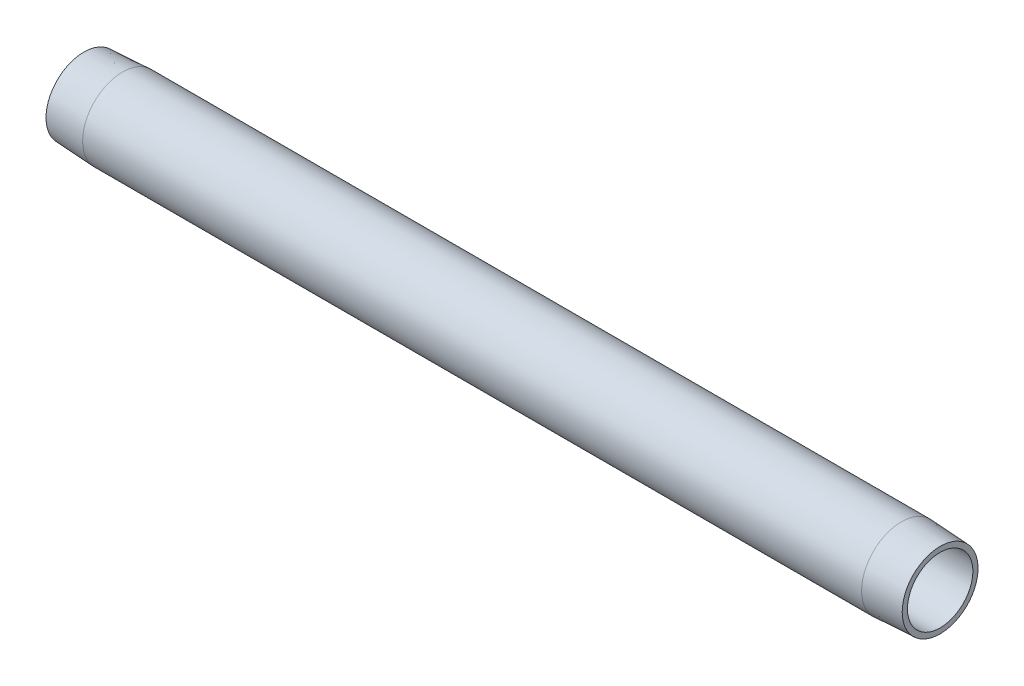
from build123d import *


with BuildPart() as part:
    # Sketch1 → Revolve1 (revolve)
    with BuildSketch(Plane.XY, mode=Mode.PRIVATE) as revolve1_sk:
        Polygon((228.6, 8.73125), (0, 8.73125), (0, 10.127550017), (10.3124, 10.668), (218.2876, 10.668), (228.6, 10.127550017), align=None)
    revolve(revolve1_sk.sketch.rotate(Axis((0, 0, 0), (1, 0, 0)), 90), axis=Axis((0, 0, 0), (1, 0, 0)))


solid = part.part
